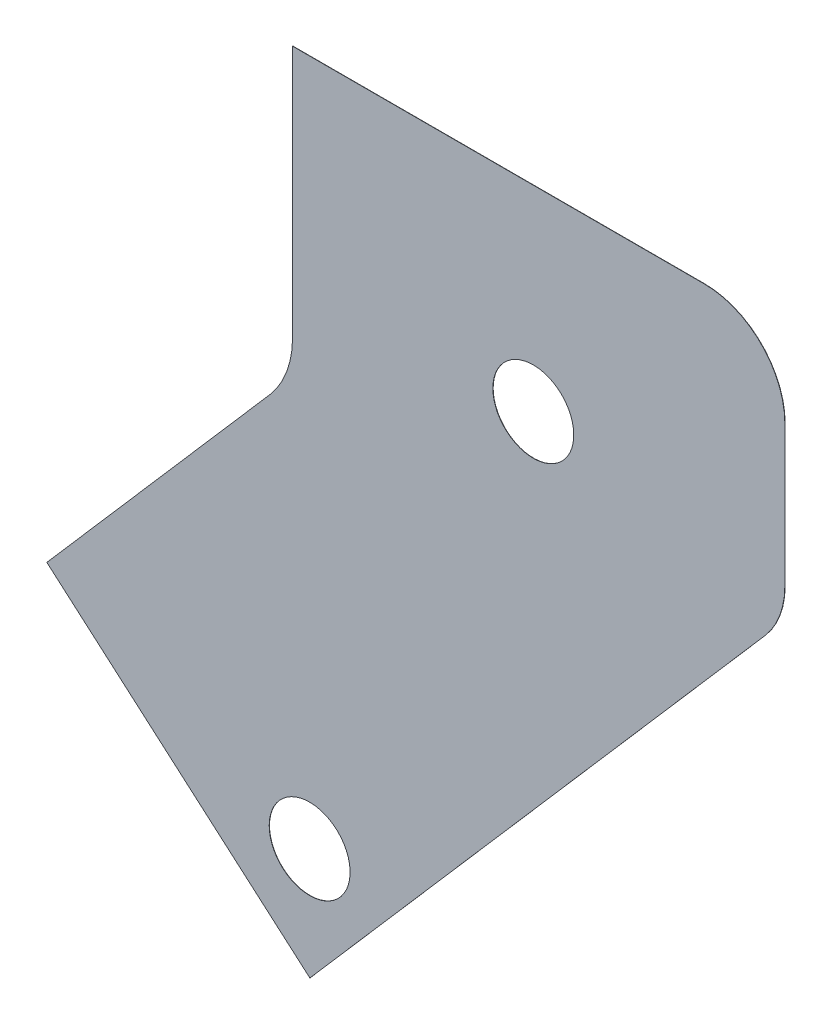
from build123d import *

# Parameters (mm, degrees)
BOSS_EXTRUDE1_DEPTH = 0.0254
HOLE1_D             = 7.1374


with BuildPart() as part:
    # Sketch1 → Boss-Extrude1 (new body)
    with BuildSketch(Plane.XY):
        with BuildLine():
            Line((-661.539783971, -84.140618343), (-621.375225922, -37.890951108))
            ThreePointArc((-621.375225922, -37.890951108), (-620.082779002, -35.716729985), (-619.633, -33.227682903))
            Line((-619.633, -33.227682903), (-619.633, -20.819872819))
            ThreePointArc((-619.633, -20.819872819), (-621.716056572, -15.790929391), (-626.745, -13.707872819))
            Line((-626.745, -13.707872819), (-663.067, -13.707872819))
            Line((-663.067, -13.707872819), (-663.067, -35.989792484))
            ThreePointArc((-663.067, -35.989792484), (-663.581033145, -38.834417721), (-665.058115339, -41.319241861))
            Line((-665.058115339, -41.319241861), (-684.744879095, -63.988637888))
            Line((-684.744879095, -63.988637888), (-661.539783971, -84.140618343))
        make_face()
    extrude(amount=BOSS_EXTRUDE1_DEPTH)

    # Hole1 (through all)
    with Locations(Plane(origin=(-638.171535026, -20.035039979, 0), x_dir=(-1, 0, 0), z_dir=(0, 0, -1))):
        with Locations((3.654260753, -10.973552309), (23.387129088, -54.249177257)):
            Hole(HOLE1_D / 2)


solid = part.part
